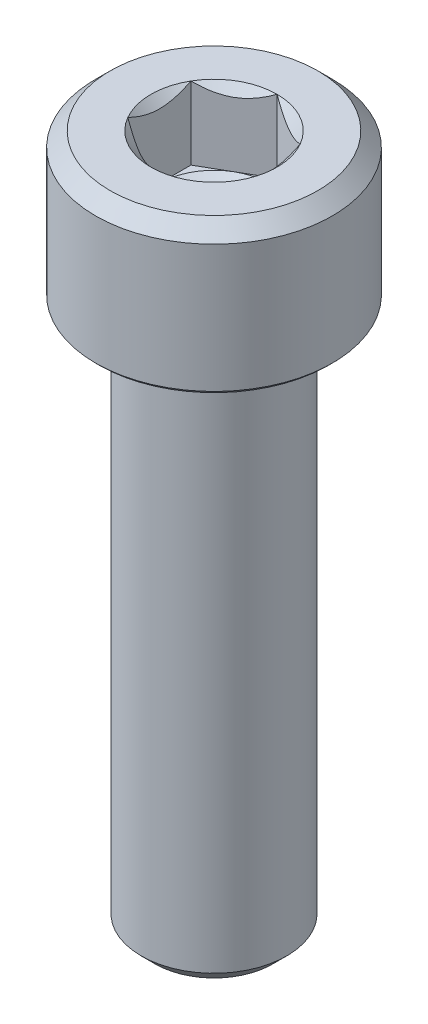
from build123d import *

# Parameters (mm, degrees)
LINEAR_AUSTRAGEN1_DEPTH = 4


with BuildPart() as part:
    # Skizze1 → Rotation1 (revolve)
    with BuildSketch(Plane.XY, mode=Mode.PRIVATE) as rotation1_sk:
        Polygon((0, 2.267949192), (3, 4), (3, 7.535898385), (3.464101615, 8), (5.7, 8), (6.5, 7.2), (6.5, 0.2), (6.3, 0), (4.05, 0), (4, -1.02), (4, -29.233), (3.233, -30), (0, -30), align=None)
    revolve(rotation1_sk.sketch.rotate(Axis((0, -30, 0), (0, 1, 0)), 270), axis=Axis((0, -30, 0), (0, 1, 0)))

    # Skizze2 → Linear austragen1 (cut)
    with BuildSketch(Plane(origin=(0, 8, 0), x_dir=(-1, 0, 0), z_dir=(0, 1, 0))):
        Polygon((3, -1.732050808), (3, 1.732050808), (0, 3.464101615), (-3, 1.732050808), (-3, -1.732050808), (0, -3.464101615), align=None)
    extrude(amount=-LINEAR_AUSTRAGEN1_DEPTH, mode=Mode.SUBTRACT)


solid = part.part
